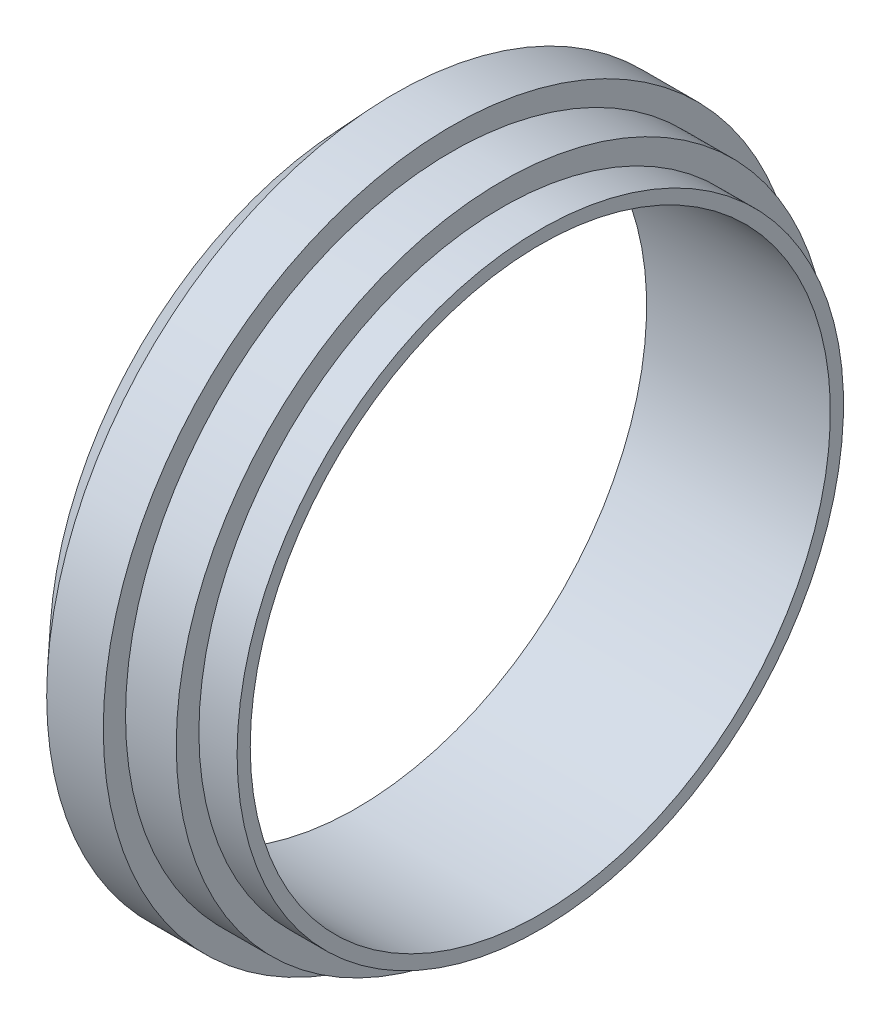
ISO-10303-21;
HEADER;
FILE_DESCRIPTION(('STEP AP214'),'2;1');
FILE_NAME('part.step','',(''),(''),'','','');
FILE_SCHEMA(('AUTOMOTIVE_DESIGN { 1 0 10303 214 1 1 1 1 }'));
ENDSEC;
DATA;
#1=APPLICATION_CONTEXT('core data for automotive mechanical design processes');
#2=APPLICATION_PROTOCOL_DEFINITION('international standard','automotive_design',2000,#1);
#3=PRODUCT_CONTEXT('',#1,'mechanical');
#4=PRODUCT('Part','Part','',(#3));
#5=PRODUCT_RELATED_PRODUCT_CATEGORY('part','',(#4));
#6=PRODUCT_DEFINITION_FORMATION('','',#4);
#7=PRODUCT_DEFINITION_CONTEXT('part definition',#1,'design');
#8=PRODUCT_DEFINITION('design','',#6,#7);
#9=PRODUCT_DEFINITION_SHAPE('','',#8);
#10=(LENGTH_UNIT() NAMED_UNIT(*) SI_UNIT(.MILLI.,.METRE.));
#11=(NAMED_UNIT(*) PLANE_ANGLE_UNIT() SI_UNIT($,.RADIAN.));
#12=(NAMED_UNIT(*) SI_UNIT($,.STERADIAN.) SOLID_ANGLE_UNIT());
#13=UNCERTAINTY_MEASURE_WITH_UNIT(LENGTH_MEASURE(1.E-05),#10,'distance_accuracy_value','');
#14=(GEOMETRIC_REPRESENTATION_CONTEXT(3) GLOBAL_UNCERTAINTY_ASSIGNED_CONTEXT((#13)) GLOBAL_UNIT_ASSIGNED_CONTEXT((#10,
#11,#12)) REPRESENTATION_CONTEXT('',''));
#15=CARTESIAN_POINT('',(0.,0.,0.));
#16=DIRECTION('',(0.,0.,1.));
#17=DIRECTION('',(1.,0.,0.));
#18=AXIS2_PLACEMENT_3D('',#15,#16,#17);
#19=CARTESIAN_POINT('',(0.,38.1,0.));
#20=DIRECTION('',(0.999999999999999,0.,0.));
#21=DIRECTION('',(0.,0.,-1.));
#22=AXIS2_PLACEMENT_3D('',#19,#20,#21);
#23=PLANE('',#22);
#24=CARTESIAN_POINT('',(1.11022302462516E-13,38.1,0.));
#25=DIRECTION('',(-0.999999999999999,0.,0.));
#26=DIRECTION('',(0.,0.,1.));
#27=AXIS2_PLACEMENT_3D('',#24,#25,#26);
#28=CIRCLE('',#27,36.449);
#29=CARTESIAN_POINT('',(1.16381303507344E-13,38.1,36.4490000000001));
#30=VERTEX_POINT('',#29);
#31=EDGE_CURVE('E70',#30,#30,#28,.T.);
#32=ORIENTED_EDGE('',*,*,#31,.T.);
#33=EDGE_LOOP('',(#32));
#34=FACE_BOUND('',#33,.T.);
#35=CARTESIAN_POINT('',(1.11022302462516E-13,38.1,0.));
#36=DIRECTION('',(-0.999999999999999,0.,0.));
#37=DIRECTION('',(0.,0.,1.));
#38=AXIS2_PLACEMENT_3D('',#35,#36,#37);
#39=CIRCLE('',#38,38.1);
#40=CARTESIAN_POINT('',(1.17961196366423E-13,38.1,38.1000000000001));
#41=VERTEX_POINT('',#40);
#42=EDGE_CURVE('E12',#41,#41,#39,.T.);
#43=ORIENTED_EDGE('',*,*,#42,.F.);
#44=EDGE_LOOP('',(#43));
#45=FACE_BOUND('',#44,.T.);
#46=ADVANCED_FACE('F42',(#34,#45),#23,.T.);
#47=CARTESIAN_POINT('',(-23.0885999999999,38.1,0.));
#48=DIRECTION('',(-0.999999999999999,0.,0.));
#49=DIRECTION('',(0.,0.,1.));
#50=AXIS2_PLACEMENT_3D('',#47,#48,#49);
#51=CYLINDRICAL_SURFACE('',#50,38.1);
#52=CARTESIAN_POINT('',(-4.80059999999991,38.1,0.));
#53=DIRECTION('',(-0.999999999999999,0.,0.));
#54=DIRECTION('',(0.,0.,1.));
#55=AXIS2_PLACEMENT_3D('',#52,#53,#54);
#56=CIRCLE('',#55,38.1);
#57=CARTESIAN_POINT('',(-4.8005999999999,38.1,38.1000000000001));
#58=VERTEX_POINT('',#57);
#59=EDGE_CURVE('E48',#58,#58,#56,.T.);
#60=CARTESIAN_POINT('',(1.17961196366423E-13,38.1,38.1000000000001));
#61=CARTESIAN_POINT('',(-0.0500062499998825,38.1,38.1000000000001));
#62=CARTESIAN_POINT('',(-0.100012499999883,38.1,38.1000000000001));
#63=CARTESIAN_POINT('',(-0.200024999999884,38.1,38.1000000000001));
#64=CARTESIAN_POINT('',(-0.250031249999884,38.1,38.1000000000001));
#65=CARTESIAN_POINT('',(-0.350043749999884,38.1,38.1000000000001));
#66=CARTESIAN_POINT('',(-0.400049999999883,38.1,38.1000000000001));
#67=CARTESIAN_POINT('',(-0.500062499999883,38.1,38.1000000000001));
#68=CARTESIAN_POINT('',(-0.550068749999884,38.1,38.1000000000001));
#69=CARTESIAN_POINT('',(-0.650081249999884,38.1,38.1000000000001));
#70=CARTESIAN_POINT('',(-0.700087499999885,38.1,38.1000000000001));
#71=CARTESIAN_POINT('',(-0.800099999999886,38.1,38.1000000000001));
#72=CARTESIAN_POINT('',(-0.850106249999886,38.1,38.1000000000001));
#73=CARTESIAN_POINT('',(-0.950118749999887,38.1,38.1000000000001));
#74=CARTESIAN_POINT('',(-1.00012499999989,38.1,38.1000000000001));
#75=CARTESIAN_POINT('',(-1.10013749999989,38.1,38.1000000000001));
#76=CARTESIAN_POINT('',(-1.15014374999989,38.1,38.1000000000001));
#77=CARTESIAN_POINT('',(-1.25015624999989,38.1,38.1000000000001));
#78=CARTESIAN_POINT('',(-1.30016249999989,38.1,38.1000000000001));
#79=CARTESIAN_POINT('',(-1.40017499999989,38.1,38.1000000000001));
#80=CARTESIAN_POINT('',(-1.45018124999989,38.1,38.1000000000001));
#81=CARTESIAN_POINT('',(-1.55019374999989,38.1,38.1000000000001));
#82=CARTESIAN_POINT('',(-1.60019999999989,38.1,38.1000000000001));
#83=CARTESIAN_POINT('',(-1.70021249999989,38.1,38.1000000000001));
#84=CARTESIAN_POINT('',(-1.75021874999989,38.1,38.1000000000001));
#85=CARTESIAN_POINT('',(-1.85023124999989,38.1,38.1000000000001));
#86=CARTESIAN_POINT('',(-1.90023749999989,38.1,38.1000000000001));
#87=CARTESIAN_POINT('',(-2.00024999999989,38.1,38.1000000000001));
#88=CARTESIAN_POINT('',(-2.05025624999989,38.1,38.1000000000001));
#89=CARTESIAN_POINT('',(-2.15026874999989,38.1,38.1000000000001));
#90=CARTESIAN_POINT('',(-2.20027499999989,38.1,38.1000000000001));
#91=CARTESIAN_POINT('',(-2.30028749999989,38.1,38.1000000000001));
#92=CARTESIAN_POINT('',(-2.35029374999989,38.1,38.1000000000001));
#93=CARTESIAN_POINT('',(-2.45030624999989,38.1,38.1000000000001));
#94=CARTESIAN_POINT('',(-2.50031249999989,38.1,38.1000000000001));
#95=CARTESIAN_POINT('',(-2.60032499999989,38.1,38.1000000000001));
#96=CARTESIAN_POINT('',(-2.65033124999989,38.1,38.1000000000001));
#97=CARTESIAN_POINT('',(-2.75034374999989,38.1,38.1000000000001));
#98=CARTESIAN_POINT('',(-2.80034999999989,38.1,38.1000000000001));
#99=CARTESIAN_POINT('',(-2.90036249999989,38.1,38.1000000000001));
#100=CARTESIAN_POINT('',(-2.95036874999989,38.1,38.1000000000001));
#101=CARTESIAN_POINT('',(-3.05038124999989,38.1,38.1000000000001));
#102=CARTESIAN_POINT('',(-3.10038749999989,38.1,38.1000000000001));
#103=CARTESIAN_POINT('',(-3.20039999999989,38.1,38.1000000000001));
#104=CARTESIAN_POINT('',(-3.25040624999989,38.1,38.1000000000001));
#105=CARTESIAN_POINT('',(-3.35041874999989,38.1,38.1000000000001));
#106=CARTESIAN_POINT('',(-3.4004249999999,38.1,38.1000000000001));
#107=CARTESIAN_POINT('',(-3.5004374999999,38.1,38.1000000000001));
#108=CARTESIAN_POINT('',(-3.5504437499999,38.1,38.1000000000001));
#109=CARTESIAN_POINT('',(-3.6504562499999,38.1,38.1000000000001));
#110=CARTESIAN_POINT('',(-3.7004624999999,38.1,38.1000000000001));
#111=CARTESIAN_POINT('',(-3.8004749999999,38.1,38.1000000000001));
#112=CARTESIAN_POINT('',(-3.8504812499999,38.1,38.1000000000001));
#113=CARTESIAN_POINT('',(-3.9504937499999,38.1,38.1000000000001));
#114=CARTESIAN_POINT('',(-4.0004999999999,38.1,38.1000000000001));
#115=CARTESIAN_POINT('',(-4.1005124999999,38.1,38.1000000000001));
#116=CARTESIAN_POINT('',(-4.1505187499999,38.1,38.1000000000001));
#117=CARTESIAN_POINT('',(-4.2505312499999,38.1,38.1000000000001));
#118=CARTESIAN_POINT('',(-4.3005374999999,38.1,38.1000000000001));
#119=CARTESIAN_POINT('',(-4.4005499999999,38.1,38.1000000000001));
#120=CARTESIAN_POINT('',(-4.4505562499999,38.1,38.1000000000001));
#121=CARTESIAN_POINT('',(-4.5505687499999,38.1,38.1000000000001));
#122=CARTESIAN_POINT('',(-4.6005749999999,38.1,38.1000000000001));
#123=CARTESIAN_POINT('',(-4.7005874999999,38.1,38.1000000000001));
#124=CARTESIAN_POINT('',(-4.7505937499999,38.1,38.1000000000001));
#125=CARTESIAN_POINT('',(-4.8005999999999,38.1,38.1000000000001));
#126=B_SPLINE_CURVE_WITH_KNOTS('',3,(#60,#61,#62,#63,#64,#65,#66,#67,#68,#69,#70,#71,#72,#73,
#74,#75,#76,#77,#78,#79,#80,#81,#82,#83,#84,#85,#86,#87,#88,#89,#90,#91,#92,#93,#94,#95,#96,#97,
#98,#99,#100,#101,#102,#103,#104,#105,#106,#107,#108,#109,#110,#111,#112,#113,#114,#115,#116,
#117,#118,#119,#120,#121,#122,#123,#124,#125),.UNSPECIFIED.,.F.,.F.,(4,2,2,2,2,2,2,2,2,2,2,2,2,
2,2,2,2,2,2,2,2,2,2,2,2,2,2,2,2,2,2,2,4),(0.,0.150018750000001,0.300037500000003,
0.450056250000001,0.600075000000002,0.750093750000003,0.900112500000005,1.05013125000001,
1.20015,1.35016875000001,1.50018750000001,1.65020625,1.80022500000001,1.95024375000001,
2.10026250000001,2.25028125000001,2.40030000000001,2.55031875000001,2.70033750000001,
2.85035625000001,3.00037500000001,3.15039375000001,3.30041250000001,3.45043125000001,
3.60045000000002,3.75046875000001,3.90048750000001,4.05050625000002,4.20052500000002,
4.35054375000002,4.50056250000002,4.65058125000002,4.80060000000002),.UNSPECIFIED.);
#127=EDGE_CURVE('BSEAM103',#41,#58,#126,.T.);
#128=ORIENTED_EDGE('',*,*,#42,.T.);
#129=ORIENTED_EDGE('',*,*,#59,.F.);
#130=ORIENTED_EDGE('',*,*,#127,.T.);
#131=ORIENTED_EDGE('',*,*,#127,.F.);
#132=EDGE_LOOP('',(#128,#130,#129,#131));
#133=FACE_BOUND('',#132,.T.);
#134=ADVANCED_FACE('F103',(#133),#51,.T.);
#135=CARTESIAN_POINT('',(-4.80059999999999,0.,0.));
#136=DIRECTION('',(0.999999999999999,0.,0.));
#137=DIRECTION('',(0.,0.,-1.));
#138=AXIS2_PLACEMENT_3D('',#135,#136,#137);
#139=PLANE('',#138);
#140=ORIENTED_EDGE('',*,*,#59,.T.);
#141=EDGE_LOOP('',(#140));
#142=FACE_BOUND('',#141,.T.);
#143=CARTESIAN_POINT('',(-4.80059999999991,38.1,0.));
#144=DIRECTION('',(-0.999999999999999,0.,0.));
#145=DIRECTION('',(0.,0.,1.));
#146=AXIS2_PLACEMENT_3D('',#143,#144,#145);
#147=CIRCLE('',#146,40.9448);
#148=CARTESIAN_POINT('',(-4.8005999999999,38.1,40.9448000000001));
#149=VERTEX_POINT('',#148);
#150=EDGE_CURVE('E52',#149,#149,#147,.T.);
#151=ORIENTED_EDGE('',*,*,#150,.F.);
#152=EDGE_LOOP('',(#151));
#153=FACE_BOUND('',#152,.T.);
#154=ADVANCED_FACE('F107',(#142,#153),#139,.T.);
#155=CARTESIAN_POINT('',(-23.0885999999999,38.1,0.));
#156=DIRECTION('',(-0.999999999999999,0.,0.));
#157=DIRECTION('',(0.,0.,1.));
#158=AXIS2_PLACEMENT_3D('',#155,#156,#157);
#159=CYLINDRICAL_SURFACE('',#158,40.9448);
#160=CARTESIAN_POINT('',(-11.1759999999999,38.1,0.));
#161=DIRECTION('',(-0.999999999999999,0.,0.));
#162=DIRECTION('',(0.,0.,1.));
#163=AXIS2_PLACEMENT_3D('',#160,#161,#162);
#164=CIRCLE('',#163,40.9448);
#165=CARTESIAN_POINT('',(-11.1759999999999,38.1,40.9448000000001));
#166=VERTEX_POINT('',#165);
#167=EDGE_CURVE('E56',#166,#166,#164,.T.);
#168=CARTESIAN_POINT('',(-4.8005999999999,38.1,40.9448000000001));
#169=CARTESIAN_POINT('',(-4.86701041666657,38.1,40.9448000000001));
#170=CARTESIAN_POINT('',(-4.93342083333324,38.1,40.9448000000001));
#171=CARTESIAN_POINT('',(-5.06624166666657,38.1,40.9448000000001));
#172=CARTESIAN_POINT('',(-5.13265208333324,38.1,40.9448000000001));
#173=CARTESIAN_POINT('',(-5.26547291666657,38.1,40.9448000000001));
#174=CARTESIAN_POINT('',(-5.33188333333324,38.1,40.9448000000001));
#175=CARTESIAN_POINT('',(-5.46470416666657,38.1,40.9448000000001));
#176=CARTESIAN_POINT('',(-5.53111458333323,38.1,40.9448000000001));
#177=CARTESIAN_POINT('',(-5.66393541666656,38.1,40.9448000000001));
#178=CARTESIAN_POINT('',(-5.73034583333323,38.1,40.9448000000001));
#179=CARTESIAN_POINT('',(-5.86316666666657,38.1,40.9448000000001));
#180=CARTESIAN_POINT('',(-5.92957708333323,38.1,40.9448000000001));
#181=CARTESIAN_POINT('',(-6.06239791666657,38.1,40.9448000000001));
#182=CARTESIAN_POINT('',(-6.12880833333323,38.1,40.9448000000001));
#183=CARTESIAN_POINT('',(-6.26162916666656,38.1,40.9448000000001));
#184=CARTESIAN_POINT('',(-6.32803958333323,38.1,40.9448000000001));
#185=CARTESIAN_POINT('',(-6.46086041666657,38.1,40.9448000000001));
#186=CARTESIAN_POINT('',(-6.52727083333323,38.1,40.9448000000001));
#187=CARTESIAN_POINT('',(-6.66009166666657,38.1,40.9448000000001));
#188=CARTESIAN_POINT('',(-6.72650208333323,38.1,40.9448000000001));
#189=CARTESIAN_POINT('',(-6.85932291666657,38.1,40.9448000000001));
#190=CARTESIAN_POINT('',(-6.92573333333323,38.1,40.9448000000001));
#191=CARTESIAN_POINT('',(-7.05855416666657,38.1,40.9448000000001));
#192=CARTESIAN_POINT('',(-7.12496458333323,38.1,40.9448000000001));
#193=CARTESIAN_POINT('',(-7.25778541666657,38.1,40.9448000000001));
#194=CARTESIAN_POINT('',(-7.32419583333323,38.1,40.9448000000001));
#195=CARTESIAN_POINT('',(-7.45701666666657,38.1,40.9448000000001));
#196=CARTESIAN_POINT('',(-7.52342708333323,38.1,40.9448000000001));
#197=CARTESIAN_POINT('',(-7.65624791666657,38.1,40.9448000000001));
#198=CARTESIAN_POINT('',(-7.72265833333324,38.1,40.9448000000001));
#199=CARTESIAN_POINT('',(-7.85547916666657,38.1,40.9448000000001));
#200=CARTESIAN_POINT('',(-7.92188958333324,38.1,40.9448000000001));
#201=CARTESIAN_POINT('',(-8.05471041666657,38.1,40.9448000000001));
#202=CARTESIAN_POINT('',(-8.12112083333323,38.1,40.9448000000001));
#203=CARTESIAN_POINT('',(-8.25394166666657,38.1,40.9448000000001));
#204=CARTESIAN_POINT('',(-8.32035208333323,38.1,40.9448000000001));
#205=CARTESIAN_POINT('',(-8.45317291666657,38.1,40.9448000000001));
#206=CARTESIAN_POINT('',(-8.51958333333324,38.1,40.9448000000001));
#207=CARTESIAN_POINT('',(-8.65240416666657,38.1,40.9448000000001));
#208=CARTESIAN_POINT('',(-8.71881458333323,38.1,40.9448000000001));
#209=CARTESIAN_POINT('',(-8.85163541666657,38.1,40.9448000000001));
#210=CARTESIAN_POINT('',(-8.91804583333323,38.1,40.9448000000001));
#211=CARTESIAN_POINT('',(-9.05086666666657,38.1,40.9448000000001));
#212=CARTESIAN_POINT('',(-9.11727708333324,38.1,40.9448000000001));
#213=CARTESIAN_POINT('',(-9.25009791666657,38.1,40.9448000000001));
#214=CARTESIAN_POINT('',(-9.31650833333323,38.1,40.9448000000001));
#215=CARTESIAN_POINT('',(-9.44932916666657,38.1,40.9448000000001));
#216=CARTESIAN_POINT('',(-9.51573958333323,38.1,40.9448000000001));
#217=CARTESIAN_POINT('',(-9.64856041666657,38.1,40.9448000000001));
#218=CARTESIAN_POINT('',(-9.71497083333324,38.1,40.9448000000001));
#219=CARTESIAN_POINT('',(-9.84779166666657,38.1,40.9448000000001));
#220=CARTESIAN_POINT('',(-9.91420208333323,38.1,40.9448000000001));
#221=CARTESIAN_POINT('',(-10.0470229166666,38.1,40.9448000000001));
#222=CARTESIAN_POINT('',(-10.1134333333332,38.1,40.9448000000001));
#223=CARTESIAN_POINT('',(-10.2462541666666,38.1,40.9448000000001));
#224=CARTESIAN_POINT('',(-10.3126645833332,38.1,40.9448000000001));
#225=CARTESIAN_POINT('',(-10.4454854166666,38.1,40.9448000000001));
#226=CARTESIAN_POINT('',(-10.5118958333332,38.1,40.9448000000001));
#227=CARTESIAN_POINT('',(-10.6447166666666,38.1,40.9448000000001));
#228=CARTESIAN_POINT('',(-10.7111270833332,38.1,40.9448000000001));
#229=CARTESIAN_POINT('',(-10.8439479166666,38.1,40.9448000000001));
#230=CARTESIAN_POINT('',(-10.9103583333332,38.1,40.9448000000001));
#231=CARTESIAN_POINT('',(-11.0431791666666,38.1,40.9448000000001));
#232=CARTESIAN_POINT('',(-11.1095895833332,38.1,40.9448000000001));
#233=CARTESIAN_POINT('',(-11.1759999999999,38.1,40.9448000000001));
#234=B_SPLINE_CURVE_WITH_KNOTS('',3,(#168,#169,#170,#171,#172,#173,#174,#175,#176,#177,#178,
#179,#180,#181,#182,#183,#184,#185,#186,#187,#188,#189,#190,#191,#192,#193,#194,#195,#196,#197,
#198,#199,#200,#201,#202,#203,#204,#205,#206,#207,#208,#209,#210,#211,#212,#213,#214,#215,#216,
#217,#218,#219,#220,#221,#222,#223,#224,#225,#226,#227,#228,#229,#230,#231,#232,#233),
.UNSPECIFIED.,.F.,.F.,(4,2,2,2,2,2,2,2,2,2,2,2,2,2,2,2,2,2,2,2,2,2,2,2,2,2,2,2,2,2,2,2,4),(0.,
0.199231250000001,0.398462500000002,0.597693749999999,0.796924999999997,0.996156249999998,
1.1953875,1.39461875,1.59385,1.79308125,1.9923125,2.19154375,2.390775,2.59000625,2.7892375,
2.98846875,3.1877,3.38693125,3.5861625,3.78539375,3.984625,4.18385625,4.3830875,4.58231875,
4.78155,4.98078125,5.1800125,5.37924375,5.578475,5.77770625,5.9769375,6.17616875,6.3754),.UNSPECIFIED.);
#235=EDGE_CURVE('BSEAM111',#149,#166,#234,.T.);
#236=ORIENTED_EDGE('',*,*,#150,.T.);
#237=ORIENTED_EDGE('',*,*,#167,.F.);
#238=ORIENTED_EDGE('',*,*,#235,.T.);
#239=ORIENTED_EDGE('',*,*,#235,.F.);
#240=EDGE_LOOP('',(#236,#238,#237,#239));
#241=FACE_BOUND('',#240,.T.);
#242=ADVANCED_FACE('F111',(#241),#159,.T.);
#243=CARTESIAN_POINT('',(-11.176,-2.84480000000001,0.));
#244=DIRECTION('',(0.999999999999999,0.,0.));
#245=DIRECTION('',(0.,0.,-1.));
#246=AXIS2_PLACEMENT_3D('',#243,#244,#245);
#247=PLANE('',#246);
#248=ORIENTED_EDGE('',*,*,#167,.T.);
#249=EDGE_LOOP('',(#248));
#250=FACE_BOUND('',#249,.T.);
#251=CARTESIAN_POINT('',(-11.1759999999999,38.1,0.));
#252=DIRECTION('',(-0.999999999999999,0.,0.));
#253=DIRECTION('',(0.,0.,1.));
#254=AXIS2_PLACEMENT_3D('',#251,#252,#253);
#255=CIRCLE('',#254,43.7388);
#256=CARTESIAN_POINT('',(-11.1759999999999,38.1,43.7388000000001));
#257=VERTEX_POINT('',#256);
#258=EDGE_CURVE('E61',#257,#257,#255,.T.);
#259=ORIENTED_EDGE('',*,*,#258,.F.);
#260=EDGE_LOOP('',(#259));
#261=FACE_BOUND('',#260,.T.);
#262=ADVANCED_FACE('F99',(#250,#261),#247,.T.);
#263=CARTESIAN_POINT('',(-23.0885999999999,38.1,0.));
#264=DIRECTION('',(-0.999999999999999,0.,0.));
#265=DIRECTION('',(0.,0.,1.));
#266=AXIS2_PLACEMENT_3D('',#263,#264,#265);
#267=CYLINDRICAL_SURFACE('',#266,43.7388);
#268=CARTESIAN_POINT('',(-18.2879999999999,38.1,0.));
#269=DIRECTION('',(-0.999999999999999,0.,0.));
#270=DIRECTION('',(0.,0.,1.));
#271=AXIS2_PLACEMENT_3D('',#268,#269,#270);
#272=CIRCLE('',#271,43.7388);
#273=CARTESIAN_POINT('',(-18.2879999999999,38.1,43.7388000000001));
#274=VERTEX_POINT('',#273);
#275=EDGE_CURVE('E64',#274,#274,#272,.T.);
#276=CARTESIAN_POINT('',(-11.1759999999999,38.1,43.7388000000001));
#277=CARTESIAN_POINT('',(-11.2500833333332,38.1,43.7388000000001));
#278=CARTESIAN_POINT('',(-11.3241666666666,38.1,43.7388000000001));
#279=CARTESIAN_POINT('',(-11.4723333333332,38.1,43.7388000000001));
#280=CARTESIAN_POINT('',(-11.5464166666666,38.1,43.7388000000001));
#281=CARTESIAN_POINT('',(-11.6945833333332,38.1,43.7388000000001));
#282=CARTESIAN_POINT('',(-11.7686666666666,38.1,43.7388000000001));
#283=CARTESIAN_POINT('',(-11.9168333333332,38.1,43.7388000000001));
#284=CARTESIAN_POINT('',(-11.9909166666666,38.1,43.7388000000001));
#285=CARTESIAN_POINT('',(-12.1390833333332,38.1,43.7388000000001));
#286=CARTESIAN_POINT('',(-12.2131666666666,38.1,43.7388000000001));
#287=CARTESIAN_POINT('',(-12.3613333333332,38.1,43.7388000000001));
#288=CARTESIAN_POINT('',(-12.4354166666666,38.1,43.7388000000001));
#289=CARTESIAN_POINT('',(-12.5835833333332,38.1,43.7388000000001));
#290=CARTESIAN_POINT('',(-12.6576666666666,38.1,43.7388000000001));
#291=CARTESIAN_POINT('',(-12.8058333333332,38.1,43.7388000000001));
#292=CARTESIAN_POINT('',(-12.8799166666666,38.1,43.7388000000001));
#293=CARTESIAN_POINT('',(-13.0280833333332,38.1,43.7388000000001));
#294=CARTESIAN_POINT('',(-13.1021666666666,38.1,43.7388000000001));
#295=CARTESIAN_POINT('',(-13.2503333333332,38.1,43.7388000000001));
#296=CARTESIAN_POINT('',(-13.3244166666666,38.1,43.7388000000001));
#297=CARTESIAN_POINT('',(-13.4725833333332,38.1,43.7388000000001));
#298=CARTESIAN_POINT('',(-13.5466666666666,38.1,43.7388000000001));
#299=CARTESIAN_POINT('',(-13.6948333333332,38.1,43.7388000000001));
#300=CARTESIAN_POINT('',(-13.7689166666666,38.1,43.7388000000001));
#301=CARTESIAN_POINT('',(-13.9170833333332,38.1,43.7388000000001));
#302=CARTESIAN_POINT('',(-13.9911666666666,38.1,43.7388000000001));
#303=CARTESIAN_POINT('',(-14.1393333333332,38.1,43.7388000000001));
#304=CARTESIAN_POINT('',(-14.2134166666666,38.1,43.7388000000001));
#305=CARTESIAN_POINT('',(-14.3615833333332,38.1,43.7388000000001));
#306=CARTESIAN_POINT('',(-14.4356666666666,38.1,43.7388000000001));
#307=CARTESIAN_POINT('',(-14.5838333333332,38.1,43.7388000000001));
#308=CARTESIAN_POINT('',(-14.6579166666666,38.1,43.7388000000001));
#309=CARTESIAN_POINT('',(-14.8060833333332,38.1,43.7388000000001));
#310=CARTESIAN_POINT('',(-14.8801666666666,38.1,43.7388000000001));
#311=CARTESIAN_POINT('',(-15.0283333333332,38.1,43.7388000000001));
#312=CARTESIAN_POINT('',(-15.1024166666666,38.1,43.7388000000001));
#313=CARTESIAN_POINT('',(-15.2505833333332,38.1,43.7388000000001));
#314=CARTESIAN_POINT('',(-15.3246666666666,38.1,43.7388000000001));
#315=CARTESIAN_POINT('',(-15.4728333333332,38.1,43.7388000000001));
#316=CARTESIAN_POINT('',(-15.5469166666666,38.1,43.7388000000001));
#317=CARTESIAN_POINT('',(-15.6950833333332,38.1,43.7388000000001));
#318=CARTESIAN_POINT('',(-15.7691666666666,38.1,43.7388000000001));
#319=CARTESIAN_POINT('',(-15.9173333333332,38.1,43.7388000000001));
#320=CARTESIAN_POINT('',(-15.9914166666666,38.1,43.7388000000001));
#321=CARTESIAN_POINT('',(-16.1395833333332,38.1,43.7388000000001));
#322=CARTESIAN_POINT('',(-16.2136666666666,38.1,43.7388000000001));
#323=CARTESIAN_POINT('',(-16.3618333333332,38.1,43.7388000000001));
#324=CARTESIAN_POINT('',(-16.4359166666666,38.1,43.7388000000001));
#325=CARTESIAN_POINT('',(-16.5840833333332,38.1,43.7388000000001));
#326=CARTESIAN_POINT('',(-16.6581666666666,38.1,43.7388000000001));
#327=CARTESIAN_POINT('',(-16.8063333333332,38.1,43.7388000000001));
#328=CARTESIAN_POINT('',(-16.8804166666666,38.1,43.7388000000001));
#329=CARTESIAN_POINT('',(-17.0285833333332,38.1,43.7388000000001));
#330=CARTESIAN_POINT('',(-17.1026666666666,38.1,43.7388000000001));
#331=CARTESIAN_POINT('',(-17.2508333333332,38.1,43.7388000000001));
#332=CARTESIAN_POINT('',(-17.3249166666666,38.1,43.7388000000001));
#333=CARTESIAN_POINT('',(-17.4730833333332,38.1,43.7388000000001));
#334=CARTESIAN_POINT('',(-17.5471666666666,38.1,43.7388000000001));
#335=CARTESIAN_POINT('',(-17.6953333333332,38.1,43.7388000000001));
#336=CARTESIAN_POINT('',(-17.7694166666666,38.1,43.7388000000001));
#337=CARTESIAN_POINT('',(-17.9175833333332,38.1,43.7388000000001));
#338=CARTESIAN_POINT('',(-17.9916666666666,38.1,43.7388000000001));
#339=CARTESIAN_POINT('',(-18.1398333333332,38.1,43.7388000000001));
#340=CARTESIAN_POINT('',(-18.2139166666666,38.1,43.7388000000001));
#341=CARTESIAN_POINT('',(-18.2879999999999,38.1,43.7388000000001));
#342=B_SPLINE_CURVE_WITH_KNOTS('',3,(#276,#277,#278,#279,#280,#281,#282,#283,#284,#285,#286,
#287,#288,#289,#290,#291,#292,#293,#294,#295,#296,#297,#298,#299,#300,#301,#302,#303,#304,#305,
#306,#307,#308,#309,#310,#311,#312,#313,#314,#315,#316,#317,#318,#319,#320,#321,#322,#323,#324,
#325,#326,#327,#328,#329,#330,#331,#332,#333,#334,#335,#336,#337,#338,#339,#340,#341),
.UNSPECIFIED.,.F.,.F.,(4,2,2,2,2,2,2,2,2,2,2,2,2,2,2,2,2,2,2,2,2,2,2,2,2,2,2,2,2,2,2,2,4),(0.,
0.22225,0.4445,0.666750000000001,0.889000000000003,1.11125,1.3335,1.55575,1.778,2.00025,2.2225,
2.44475,2.667,2.88925,3.1115,3.33375,3.556,3.77825000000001,4.00050000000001,4.22275000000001,
4.44500000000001,4.66725,4.88950000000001,5.11175000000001,5.33400000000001,5.55625000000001,
5.77850000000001,6.00075000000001,6.22300000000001,6.44525000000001,6.66750000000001,
6.88975000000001,7.11200000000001),.UNSPECIFIED.);
#343=EDGE_CURVE('BSEAM93',#257,#274,#342,.T.);
#344=ORIENTED_EDGE('',*,*,#258,.T.);
#345=ORIENTED_EDGE('',*,*,#275,.F.);
#346=ORIENTED_EDGE('',*,*,#343,.T.);
#347=ORIENTED_EDGE('',*,*,#343,.F.);
#348=EDGE_LOOP('',(#344,#346,#345,#347));
#349=FACE_BOUND('',#348,.T.);
#350=ADVANCED_FACE('F93',(#349),#267,.T.);
#351=CARTESIAN_POINT('',(-23.0885999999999,38.1,0.));
#352=DIRECTION('',(0.999999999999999,0.,0.));
#353=DIRECTION('',(0.,0.,-1.));
#354=AXIS2_PLACEMENT_3D('',#351,#352,#353);
#355=CONICAL_SURFACE('',#354,38.5826,0.821097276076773);
#356=ORIENTED_EDGE('',*,*,#275,.T.);
#357=EDGE_LOOP('',(#356));
#358=FACE_BOUND('',#357,.T.);
#359=CARTESIAN_POINT('',(-23.0885999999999,38.1,0.));
#360=DIRECTION('',(-0.999999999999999,0.,0.));
#361=DIRECTION('',(0.,0.,1.));
#362=AXIS2_PLACEMENT_3D('',#359,#360,#361);
#363=CIRCLE('',#362,38.5826);
#364=CARTESIAN_POINT('',(-23.0885999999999,38.1,38.5826));
#365=VERTEX_POINT('',#364);
#366=EDGE_CURVE('E67',#365,#365,#363,.T.);
#367=ORIENTED_EDGE('',*,*,#366,.F.);
#368=EDGE_LOOP('',(#367));
#369=FACE_BOUND('',#368,.T.);
#370=ADVANCED_FACE('F88',(#358,#369),#355,.T.);
#371=CARTESIAN_POINT('',(-23.0886,-0.482599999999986,0.));
#372=DIRECTION('',(-0.999999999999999,0.,0.));
#373=DIRECTION('',(0.,0.,1.));
#374=AXIS2_PLACEMENT_3D('',#371,#372,#373);
#375=PLANE('',#374);
#376=CARTESIAN_POINT('',(-23.0885999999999,38.1,0.));
#377=DIRECTION('',(-0.999999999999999,0.,0.));
#378=DIRECTION('',(0.,0.,1.));
#379=AXIS2_PLACEMENT_3D('',#376,#377,#378);
#380=CIRCLE('',#379,36.449);
#381=CARTESIAN_POINT('',(-23.0885999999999,38.1,36.4490000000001));
#382=VERTEX_POINT('',#381);
#383=EDGE_CURVE('E71',#382,#382,#380,.T.);
#384=ORIENTED_EDGE('',*,*,#383,.F.);
#385=EDGE_LOOP('',(#384));
#386=FACE_BOUND('',#385,.T.);
#387=ORIENTED_EDGE('',*,*,#366,.T.);
#388=EDGE_LOOP('',(#387));
#389=FACE_BOUND('',#388,.T.);
#390=ADVANCED_FACE('F82',(#386,#389),#375,.T.);
#391=CARTESIAN_POINT('',(1.11022302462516E-13,38.1,0.));
#392=DIRECTION('',(-0.999999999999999,0.,0.));
#393=DIRECTION('',(0.,0.,1.));
#394=AXIS2_PLACEMENT_3D('',#391,#392,#393);
#395=CYLINDRICAL_SURFACE('',#394,36.449);
#396=CARTESIAN_POINT('',(1.16381303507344E-13,38.1,36.4490000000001));
#397=CARTESIAN_POINT('',(-0.240506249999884,38.1,36.4490000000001));
#398=CARTESIAN_POINT('',(-0.481012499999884,38.1,36.4490000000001));
#399=CARTESIAN_POINT('',(-0.962024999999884,38.1,36.4490000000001));
#400=CARTESIAN_POINT('',(-1.20253124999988,38.1,36.4490000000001));
#401=CARTESIAN_POINT('',(-1.68354374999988,38.1,36.4490000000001));
#402=CARTESIAN_POINT('',(-1.92404999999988,38.1,36.4490000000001));
#403=CARTESIAN_POINT('',(-2.40506249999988,38.1,36.4490000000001));
#404=CARTESIAN_POINT('',(-2.64556874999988,38.1,36.4490000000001));
#405=CARTESIAN_POINT('',(-3.12658124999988,38.1,36.4490000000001));
#406=CARTESIAN_POINT('',(-3.36708749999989,38.1,36.4490000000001));
#407=CARTESIAN_POINT('',(-3.84809999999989,38.1,36.4490000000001));
#408=CARTESIAN_POINT('',(-4.08860624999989,38.1,36.4490000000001));
#409=CARTESIAN_POINT('',(-4.56961874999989,38.1,36.4490000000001));
#410=CARTESIAN_POINT('',(-4.81012499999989,38.1,36.4490000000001));
#411=CARTESIAN_POINT('',(-5.29113749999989,38.1,36.4490000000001));
#412=CARTESIAN_POINT('',(-5.53164374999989,38.1,36.4490000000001));
#413=CARTESIAN_POINT('',(-6.01265624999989,38.1,36.4490000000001));
#414=CARTESIAN_POINT('',(-6.25316249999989,38.1,36.4490000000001));
#415=CARTESIAN_POINT('',(-6.73417499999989,38.1,36.4490000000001));
#416=CARTESIAN_POINT('',(-6.97468124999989,38.1,36.4490000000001));
#417=CARTESIAN_POINT('',(-7.45569374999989,38.1,36.4490000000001));
#418=CARTESIAN_POINT('',(-7.69619999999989,38.1,36.4490000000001));
#419=CARTESIAN_POINT('',(-8.17721249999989,38.1,36.4490000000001));
#420=CARTESIAN_POINT('',(-8.41771874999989,38.1,36.4490000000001));
#421=CARTESIAN_POINT('',(-8.89873124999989,38.1,36.4490000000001));
#422=CARTESIAN_POINT('',(-9.13923749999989,38.1,36.4490000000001));
#423=CARTESIAN_POINT('',(-9.62024999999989,38.1,36.4490000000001));
#424=CARTESIAN_POINT('',(-9.86075624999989,38.1,36.4490000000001));
#425=CARTESIAN_POINT('',(-10.3417687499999,38.1,36.4490000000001));
#426=CARTESIAN_POINT('',(-10.5822749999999,38.1,36.4490000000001));
#427=CARTESIAN_POINT('',(-11.0632874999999,38.1,36.4490000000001));
#428=CARTESIAN_POINT('',(-11.3037937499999,38.1,36.4490000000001));
#429=CARTESIAN_POINT('',(-11.7848062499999,38.1,36.4490000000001));
#430=CARTESIAN_POINT('',(-12.0253124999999,38.1,36.4490000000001));
#431=CARTESIAN_POINT('',(-12.5063249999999,38.1,36.4490000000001));
#432=CARTESIAN_POINT('',(-12.7468312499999,38.1,36.4490000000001));
#433=CARTESIAN_POINT('',(-13.2278437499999,38.1,36.4490000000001));
#434=CARTESIAN_POINT('',(-13.4683499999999,38.1,36.4490000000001));
#435=CARTESIAN_POINT('',(-13.9493624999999,38.1,36.4490000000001));
#436=CARTESIAN_POINT('',(-14.1898687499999,38.1,36.4490000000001));
#437=CARTESIAN_POINT('',(-14.6708812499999,38.1,36.4490000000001));
#438=CARTESIAN_POINT('',(-14.9113874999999,38.1,36.4490000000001));
#439=CARTESIAN_POINT('',(-15.3923999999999,38.1,36.4490000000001));
#440=CARTESIAN_POINT('',(-15.6329062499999,38.1,36.4490000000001));
#441=CARTESIAN_POINT('',(-16.1139187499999,38.1,36.4490000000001));
#442=CARTESIAN_POINT('',(-16.3544249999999,38.1,36.4490000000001));
#443=CARTESIAN_POINT('',(-16.8354374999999,38.1,36.4490000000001));
#444=CARTESIAN_POINT('',(-17.0759437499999,38.1,36.4490000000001));
#445=CARTESIAN_POINT('',(-17.5569562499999,38.1,36.4490000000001));
#446=CARTESIAN_POINT('',(-17.7974624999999,38.1,36.4490000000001));
#447=CARTESIAN_POINT('',(-18.2784749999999,38.1,36.4490000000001));
#448=CARTESIAN_POINT('',(-18.5189812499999,38.1,36.4490000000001));
#449=CARTESIAN_POINT('',(-18.9999937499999,38.1,36.4490000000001));
#450=CARTESIAN_POINT('',(-19.2404999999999,38.1,36.4490000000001));
#451=CARTESIAN_POINT('',(-19.7215124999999,38.1,36.4490000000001));
#452=CARTESIAN_POINT('',(-19.9620187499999,38.1,36.4490000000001));
#453=CARTESIAN_POINT('',(-20.4430312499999,38.1,36.4490000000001));
#454=CARTESIAN_POINT('',(-20.6835374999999,38.1,36.4490000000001));
#455=CARTESIAN_POINT('',(-21.1645499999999,38.1,36.4490000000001));
#456=CARTESIAN_POINT('',(-21.4050562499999,38.1,36.4490000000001));
#457=CARTESIAN_POINT('',(-21.8860687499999,38.1,36.4490000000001));
#458=CARTESIAN_POINT('',(-22.1265749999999,38.1,36.4490000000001));
#459=CARTESIAN_POINT('',(-22.6075874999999,38.1,36.4490000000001));
#460=CARTESIAN_POINT('',(-22.8480937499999,38.1,36.4490000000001));
#461=CARTESIAN_POINT('',(-23.0885999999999,38.1,36.4490000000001));
#462=B_SPLINE_CURVE_WITH_KNOTS('',3,(#396,#397,#398,#399,#400,#401,#402,#403,#404,#405,#406,
#407,#408,#409,#410,#411,#412,#413,#414,#415,#416,#417,#418,#419,#420,#421,#422,#423,#424,#425,
#426,#427,#428,#429,#430,#431,#432,#433,#434,#435,#436,#437,#438,#439,#440,#441,#442,#443,#444,
#445,#446,#447,#448,#449,#450,#451,#452,#453,#454,#455,#456,#457,#458,#459,#460,#461),
.UNSPECIFIED.,.F.,.F.,(4,2,2,2,2,2,2,2,2,2,2,2,2,2,2,2,2,2,2,2,2,2,2,2,2,2,2,2,2,2,2,2,4),(0.,
0.72151875,1.4430375,2.16455625,2.886075,3.60759375,4.3291125,5.05063125,5.77215,6.49366875,
7.2151875,7.93670625,8.65822500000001,9.37974375,10.1012625,10.82278125,11.5443,12.26581875,
12.9873375,13.70885625,14.430375,15.15189375,15.8734125,16.59493125,17.31645,18.03796875,
18.7594875,19.48100625,20.202525,20.92404375,21.6455625,22.36708125,23.0886),.UNSPECIFIED.);
#463=EDGE_CURVE('BSEAM79',#30,#382,#462,.T.);
#464=ORIENTED_EDGE('',*,*,#31,.F.);
#465=ORIENTED_EDGE('',*,*,#383,.T.);
#466=ORIENTED_EDGE('',*,*,#463,.T.);
#467=ORIENTED_EDGE('',*,*,#463,.F.);
#468=EDGE_LOOP('',(#464,#466,#465,#467));
#469=FACE_BOUND('',#468,.T.);
#470=ADVANCED_FACE('F79',(#469),#395,.F.);
#471=CLOSED_SHELL('',(#46,#134,#154,#242,#262,#350,#370,#390,#470));
#472=MANIFOLD_SOLID_BREP('B2',#471);
#473=ADVANCED_BREP_SHAPE_REPRESENTATION('',(#18,#472),#14);
#474=SHAPE_DEFINITION_REPRESENTATION(#9,#473);
ENDSEC;
END-ISO-10303-21;
